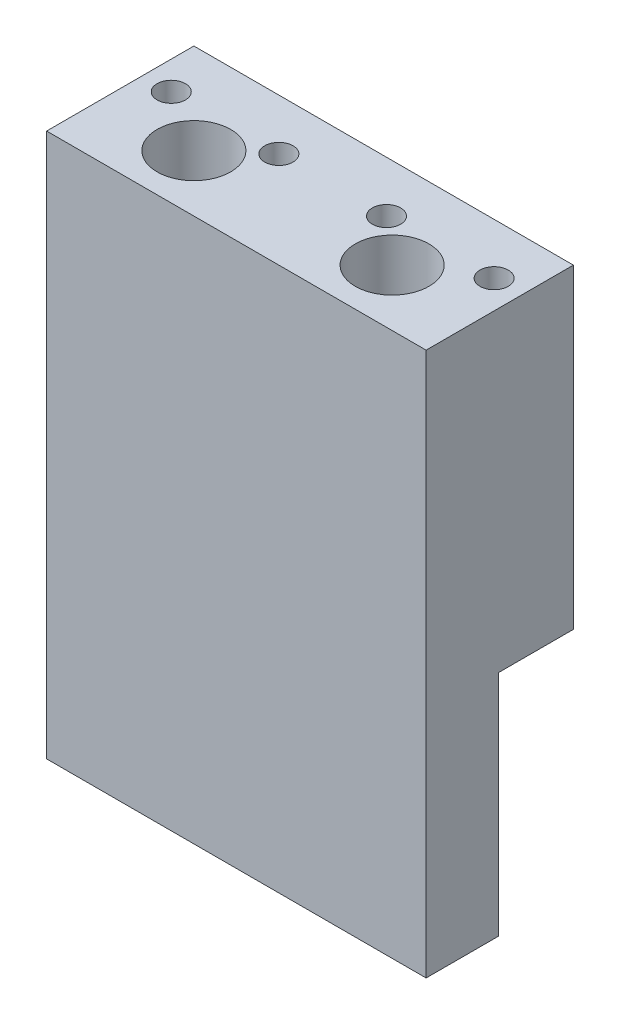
from build123d import *

# Parameters (mm, degrees)
EXTRUDE_1_DEPTH     = 13
SKETCH_2_OUTSIDE_W  = 27.314
SKETCH_2_OUTSIDE_H  = 64.314
CUT_EXTRUDE_1_DEPTH = 62.573127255
SKETCH_3_R          = 0.75
CUT_EXTRUDE_2_DEPTH = 62.573127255
SKETCH_4_R          = 1.25
CUT_EXTRUDE_3_DEPTH = 13
SKETCH_5_R          = 1.25
SKETCH_5_R_2        = 3.25
CUT_EXTRUDE_4_DEPTH = 10


with BuildPart() as part:
    # Sketch 1 → Extrude 1 (new body)
    with BuildSketch(Plane.XY):
        Polygon((0, 2), (1.5525, 2), (1.5525, 0.5), (2.0525, 0), (2.9525, 0), (3.4525, 0.5), (3.4525, 2), (4.0525, 2), (4.0525, 0.5), (4.5525, 0), (5.4525, 0), (5.9525, 0.5), (5.9525, 2), (6.5525, 2), (6.5525, 0.5), (7.0525, 0), (7.4525, 0), (7.9525, 0.5), (7.9525, 2), (8.5525, 2), (8.5525, 0.5), (9.0525, 0), (9.9525, 0), (10.4525, 0.5), (10.4525, 2), (11.0525, 2), (11.0525, 0.5), (11.5525, 0), (12.4525, 0), (12.9525, 0.5), (12.9525, 2), (20.5525, 2), (20.5525, 0.5), (21.0525, 0), (21.9525, 0), (22.4525, 0.5), (22.4525, 2), (23.0525, 2), (23.0525, 0.5), (23.5525, 0), (24.4525, 0), (24.9525, 0.5), (24.9525, 2), (25.5525, 2), (25.5525, 0.5), (26.0525, 0), (26.4525, 0), (26.9525, 0.5), (26.9525, 2), (27.5525, 2), (27.5525, 0.5), (28.0525, 0), (28.9525, 0), (29.4525, 0.5), (29.4525, 2), (30.0525, 2), (30.0525, 0.5), (30.5525, 0), (31.4525, 0), (31.9525, 0.5), (31.9525, 2), (33.5, 2), (33.5, 50), (0, 50), align=None)
    extrude(amount=EXTRUDE_1_DEPTH)

    # Sketch 2 outside → Cut-Extrude 1 (cut, through all)
    with BuildSketch(Plane(origin=(33.5, 0, 0), x_dir=(0, 0, -1), z_dir=(1, 0, 0))):
        with Locations((-6.5, 25)):
            Rectangle(SKETCH_2_OUTSIDE_W, SKETCH_2_OUTSIDE_H)
        Polygon((-6.6, 0), (-6.6, 22.15), (0, 22.15), (0, 50), (-13, 50), (-13, 2), (-8.9, 2), (-8.9, 0), align=None, mode=Mode.SUBTRACT)
    extrude(amount=-CUT_EXTRUDE_1_DEPTH, mode=Mode.SUBTRACT)

    # Sketch 3 → Cut-Extrude 2 (cut, through all)
    with BuildSketch(Plane(origin=(0, 50, 0), x_dir=(1, 0, 0), z_dir=(0, 1, 0))):
        with Locations(Location((2.5025, -4.5, 0), (0, 0, 270))):
            Circle(SKETCH_3_R)
        with Locations(Location((12.0025, -4.5, 0), (0, 0, 270))):
            Circle(SKETCH_3_R)
        with Locations(Location((21.5025, -4.5, 0), (0, 0, 270))):
            Circle(SKETCH_3_R)
        with Locations(Location((31.0025, -4.5, 0), (0, 0, 270))):
            Circle(SKETCH_3_R)
    extrude(amount=-CUT_EXTRUDE_2_DEPTH, mode=Mode.SUBTRACT)

    # Sketch 4 → Cut-Extrude 3 (cut)
    with BuildSketch(Plane(origin=(0, 50, 0), x_dir=(1, 0, 0), z_dir=(0, 1, 0))):
        with Locations(Location((31.0025, -4.5, 0), (0, 0, 270))):
            Circle(SKETCH_4_R)
        with Locations(Location((21.5025, -4.5, 0), (0, 0, 270))):
            Circle(SKETCH_4_R)
        with Locations(Location((12.0025, -4.5, 0), (0, 0, 270))):
            Circle(SKETCH_4_R)
        with Locations(Location((2.5025, -4.5, 0), (0, 0, 270))):
            Circle(SKETCH_4_R)
    extrude(amount=-CUT_EXTRUDE_3_DEPTH, mode=Mode.SUBTRACT)

    # Sketch 5 → Cut-Extrude 4 (cut)
    with BuildSketch(Plane(origin=(0, 50, 0), x_dir=(1, 0, 0), z_dir=(0, 1, 0))):
        with Locations(Location((31.0025, -4.5, 0), (0, 0, 270))):
            Circle(SKETCH_5_R)
        with Locations(Location((21.5025, -4.5, 0), (0, 0, 270))):
            Circle(SKETCH_5_R)
        with Locations(Location((12.0025, -4.5, 0), (0, 0, 270))):
            Circle(SKETCH_5_R)
        with Locations(Location((2.5025, -4.5, 0), (0, 0, 270))):
            Circle(SKETCH_5_R)
        with Locations(Location((8, -8, 0), (0, 0, 270))):
            Circle(SKETCH_5_R_2)
        with Locations(Location((25.5, -8, 0), (0, 0, 270))):
            Circle(SKETCH_5_R_2)
    extrude(amount=-CUT_EXTRUDE_4_DEPTH, mode=Mode.SUBTRACT)


solid = part.part
